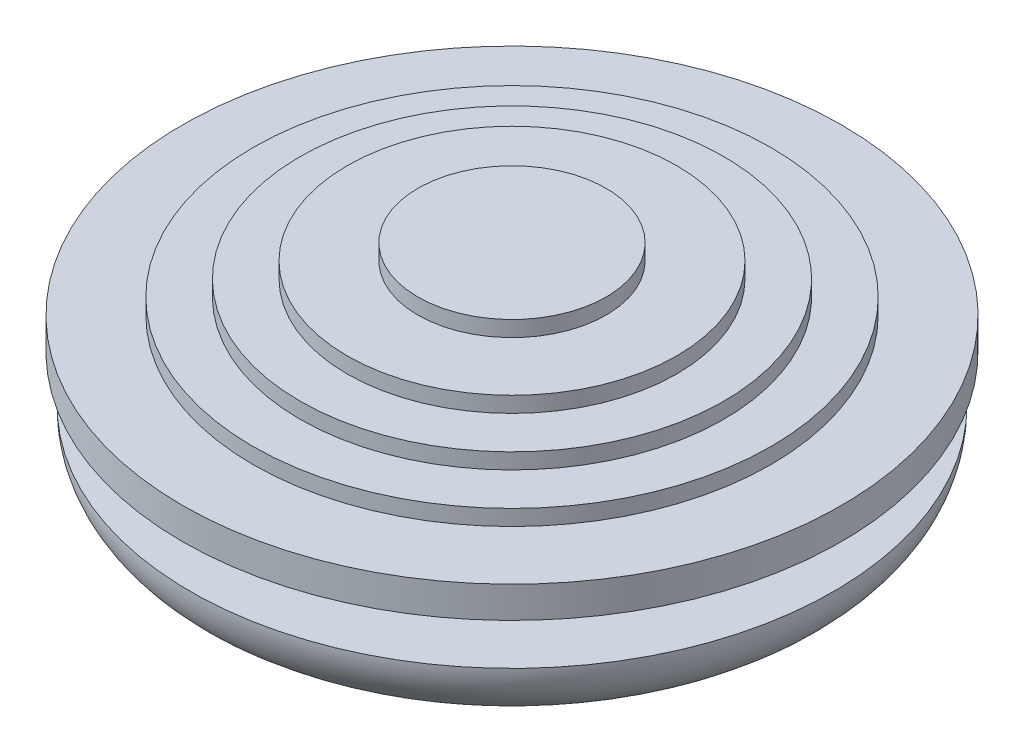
ISO-10303-21;
HEADER;
FILE_DESCRIPTION(('STEP AP214'),'2;1');
FILE_NAME('part.step','',(''),(''),'','','');
FILE_SCHEMA(('AUTOMOTIVE_DESIGN { 1 0 10303 214 1 1 1 1 }'));
ENDSEC;
DATA;
#1=APPLICATION_CONTEXT('core data for automotive mechanical design processes');
#2=APPLICATION_PROTOCOL_DEFINITION('international standard','automotive_design',2000,#1);
#3=PRODUCT_CONTEXT('',#1,'mechanical');
#4=PRODUCT('Part','Part','',(#3));
#5=PRODUCT_RELATED_PRODUCT_CATEGORY('part','',(#4));
#6=PRODUCT_DEFINITION_FORMATION('','',#4);
#7=PRODUCT_DEFINITION_CONTEXT('part definition',#1,'design');
#8=PRODUCT_DEFINITION('design','',#6,#7);
#9=PRODUCT_DEFINITION_SHAPE('','',#8);
#10=(LENGTH_UNIT() NAMED_UNIT(*) SI_UNIT(.MILLI.,.METRE.));
#11=(NAMED_UNIT(*) PLANE_ANGLE_UNIT() SI_UNIT($,.RADIAN.));
#12=(NAMED_UNIT(*) SI_UNIT($,.STERADIAN.) SOLID_ANGLE_UNIT());
#13=UNCERTAINTY_MEASURE_WITH_UNIT(LENGTH_MEASURE(1.E-05),#10,'distance_accuracy_value','');
#14=(GEOMETRIC_REPRESENTATION_CONTEXT(3) GLOBAL_UNCERTAINTY_ASSIGNED_CONTEXT((#13)) GLOBAL_UNIT_ASSIGNED_CONTEXT((#10,
#11,#12)) REPRESENTATION_CONTEXT('',''));
#15=CARTESIAN_POINT('',(0.,0.,0.));
#16=DIRECTION('',(0.,0.,1.));
#17=DIRECTION('',(1.,0.,0.));
#18=AXIS2_PLACEMENT_3D('',#15,#16,#17);
#19=CARTESIAN_POINT('',(0.,-3.,0.));
#20=DIRECTION('',(0.,-1.,0.));
#21=DIRECTION('',(0.,0.,-1.));
#22=AXIS2_PLACEMENT_3D('',#19,#20,#21);
#23=PLANE('',#22);
#24=CARTESIAN_POINT('',(0.,-3.,0.));
#25=DIRECTION('',(0.,-1.,0.));
#26=DIRECTION('',(0.,0.,-1.));
#27=AXIS2_PLACEMENT_3D('',#24,#25,#26);
#28=CIRCLE('',#27,20.5);
#29=CARTESIAN_POINT('',(0.,-3.,-20.5));
#30=VERTEX_POINT('',#29);
#31=EDGE_CURVE('E11',#30,#30,#28,.T.);
#32=ORIENTED_EDGE('',*,*,#31,.F.);
#33=EDGE_LOOP('',(#32));
#34=FACE_BOUND('',#33,.T.);
#35=CARTESIAN_POINT('',(0.,-3.,0.));
#36=DIRECTION('',(0.,-1.,0.));
#37=DIRECTION('',(0.,0.,-1.));
#38=AXIS2_PLACEMENT_3D('',#35,#36,#37);
#39=CIRCLE('',#38,16.5);
#40=CARTESIAN_POINT('',(0.,-3.,-16.5));
#41=VERTEX_POINT('',#40);
#42=EDGE_CURVE('E57',#41,#41,#39,.T.);
#43=ORIENTED_EDGE('',*,*,#42,.T.);
#44=EDGE_LOOP('',(#43));
#45=FACE_BOUND('',#44,.T.);
#46=ADVANCED_FACE('F44',(#34,#45),#23,.F.);
#47=CARTESIAN_POINT('',(0.,-7.,0.));
#48=DIRECTION('',(0.,1.,0.));
#49=DIRECTION('',(0.,0.,1.));
#50=AXIS2_PLACEMENT_3D('',#47,#48,#49);
#51=CYLINDRICAL_SURFACE('',#50,16.5);
#52=CARTESIAN_POINT('',(0.,-7.,0.));
#53=DIRECTION('',(0.,-1.,0.));
#54=DIRECTION('',(0.,0.,-1.));
#55=AXIS2_PLACEMENT_3D('',#52,#53,#54);
#56=CIRCLE('',#55,16.5);
#57=CARTESIAN_POINT('',(0.,-7.,-16.5));
#58=VERTEX_POINT('',#57);
#59=EDGE_CURVE('E52',#58,#58,#56,.T.);
#60=ORIENTED_EDGE('',*,*,#59,.T.);
#61=EDGE_LOOP('',(#60));
#62=FACE_BOUND('',#61,.T.);
#63=ORIENTED_EDGE('',*,*,#42,.F.);
#64=EDGE_LOOP('',(#63));
#65=FACE_BOUND('',#64,.T.);
#66=ADVANCED_FACE('F66',(#62,#65),#51,.F.);
#67=CARTESIAN_POINT('',(0.,-3.,0.));
#68=DIRECTION('',(0.,-1.,0.));
#69=DIRECTION('',(0.,0.,-1.));
#70=AXIS2_PLACEMENT_3D('',#67,#68,#69);
#71=TOROIDAL_SURFACE('',#70,16.5,4.);
#72=ORIENTED_EDGE('',*,*,#31,.T.);
#73=EDGE_LOOP('',(#72));
#74=FACE_BOUND('',#73,.T.);
#75=ORIENTED_EDGE('',*,*,#59,.F.);
#76=EDGE_LOOP('',(#75));
#77=FACE_BOUND('',#76,.T.);
#78=ADVANCED_FACE('F46',(#74,#77),#71,.T.);
#79=CLOSED_SHELL('',(#46,#66,#78));
#80=MANIFOLD_SOLID_BREP('B2',#79);
#81=CARTESIAN_POINT('',(0.,-3.,0.));
#82=DIRECTION('',(0.,-1.,0.));
#83=DIRECTION('',(0.,0.,-1.));
#84=AXIS2_PLACEMENT_3D('',#81,#82,#83);
#85=PLANE('',#84);
#86=CARTESIAN_POINT('',(0.,-3.,0.));
#87=DIRECTION('',(0.,-1.,0.));
#88=DIRECTION('',(0.,0.,-1.));
#89=AXIS2_PLACEMENT_3D('',#86,#87,#88);
#90=CIRCLE('',#89,16.5);
#91=CARTESIAN_POINT('',(0.,-3.,-16.5));
#92=VERTEX_POINT('',#91);
#93=EDGE_CURVE('E43',#92,#92,#90,.T.);
#94=ORIENTED_EDGE('',*,*,#93,.T.);
#95=EDGE_LOOP('',(#94));
#96=FACE_BOUND('',#95,.T.);
#97=CARTESIAN_POINT('',(0.,-3.,0.));
#98=DIRECTION('',(0.,-1.,0.));
#99=DIRECTION('',(0.,0.,-1.));
#100=AXIS2_PLACEMENT_3D('',#97,#98,#99);
#101=CIRCLE('',#100,15.5);
#102=CARTESIAN_POINT('',(0.,-3.,-15.5));
#103=VERTEX_POINT('',#102);
#104=EDGE_CURVE('E113',#103,#103,#101,.T.);
#105=ORIENTED_EDGE('',*,*,#104,.F.);
#106=EDGE_LOOP('',(#105));
#107=FACE_BOUND('',#106,.T.);
#108=ADVANCED_FACE('F102',(#96,#107),#85,.T.);
#109=CARTESIAN_POINT('',(0.,0.,0.));
#110=DIRECTION('',(0.,-1.,0.));
#111=DIRECTION('',(0.,0.,-1.));
#112=AXIS2_PLACEMENT_3D('',#109,#110,#111);
#113=PLANE('',#112);
#114=CARTESIAN_POINT('',(0.,0.,0.));
#115=DIRECTION('',(0.,-1.,0.));
#116=DIRECTION('',(0.,0.,-1.));
#117=AXIS2_PLACEMENT_3D('',#114,#115,#116);
#118=CIRCLE('',#117,16.5);
#119=CARTESIAN_POINT('',(0.,0.,-16.5));
#120=VERTEX_POINT('',#119);
#121=EDGE_CURVE('E106',#120,#120,#118,.T.);
#122=ORIENTED_EDGE('',*,*,#121,.F.);
#123=EDGE_LOOP('',(#122));
#124=FACE_BOUND('',#123,.T.);
#125=CARTESIAN_POINT('',(0.,0.,0.));
#126=DIRECTION('',(0.,-1.,0.));
#127=DIRECTION('',(0.,0.,-1.));
#128=AXIS2_PLACEMENT_3D('',#125,#126,#127);
#129=CIRCLE('',#128,15.5);
#130=CARTESIAN_POINT('',(0.,0.,-15.5));
#131=VERTEX_POINT('',#130);
#132=EDGE_CURVE('E115',#131,#131,#129,.T.);
#133=ORIENTED_EDGE('',*,*,#132,.T.);
#134=EDGE_LOOP('',(#133));
#135=FACE_BOUND('',#134,.T.);
#136=ADVANCED_FACE('F125',(#124,#135),#113,.F.);
#137=CARTESIAN_POINT('',(0.,-3.,0.));
#138=DIRECTION('',(0.,1.,0.));
#139=DIRECTION('',(0.,0.,1.));
#140=AXIS2_PLACEMENT_3D('',#137,#138,#139);
#141=CYLINDRICAL_SURFACE('',#140,16.5);
#142=ORIENTED_EDGE('',*,*,#93,.F.);
#143=EDGE_LOOP('',(#142));
#144=FACE_BOUND('',#143,.T.);
#145=ORIENTED_EDGE('',*,*,#121,.T.);
#146=EDGE_LOOP('',(#145));
#147=FACE_BOUND('',#146,.T.);
#148=ADVANCED_FACE('F104',(#144,#147),#141,.T.);
#149=CARTESIAN_POINT('',(0.,-3.,0.));
#150=DIRECTION('',(0.,1.,0.));
#151=DIRECTION('',(0.,0.,1.));
#152=AXIS2_PLACEMENT_3D('',#149,#150,#151);
#153=CYLINDRICAL_SURFACE('',#152,15.5);
#154=ORIENTED_EDGE('',*,*,#104,.T.);
#155=EDGE_LOOP('',(#154));
#156=FACE_BOUND('',#155,.T.);
#157=ORIENTED_EDGE('',*,*,#132,.F.);
#158=EDGE_LOOP('',(#157));
#159=FACE_BOUND('',#158,.T.);
#160=ADVANCED_FACE('F121',(#156,#159),#153,.F.);
#161=CLOSED_SHELL('',(#108,#136,#148,#160));
#162=MANIFOLD_SOLID_BREP('B6',#161);
#163=CARTESIAN_POINT('',(0.,6.,0.));
#164=DIRECTION('',(0.,-1.,0.));
#165=DIRECTION('',(0.,0.,-1.));
#166=AXIS2_PLACEMENT_3D('',#163,#164,#165);
#167=CYLINDRICAL_SURFACE('',#166,6.);
#168=CARTESIAN_POINT('',(0.,6.,0.));
#169=DIRECTION('',(0.,1.,0.));
#170=DIRECTION('',(0.,0.,1.));
#171=AXIS2_PLACEMENT_3D('',#168,#169,#170);
#172=CIRCLE('',#171,6.);
#173=CARTESIAN_POINT('',(0.,6.,6.));
#174=VERTEX_POINT('',#173);
#175=EDGE_CURVE('E101',#174,#174,#172,.T.);
#176=ORIENTED_EDGE('',*,*,#175,.F.);
#177=EDGE_LOOP('',(#176));
#178=FACE_BOUND('',#177,.T.);
#179=CARTESIAN_POINT('',(0.,5.,0.));
#180=DIRECTION('',(0.,1.,0.));
#181=DIRECTION('',(0.,0.,1.));
#182=AXIS2_PLACEMENT_3D('',#179,#180,#181);
#183=CIRCLE('',#182,6.);
#184=CARTESIAN_POINT('',(0.,5.,6.));
#185=VERTEX_POINT('',#184);
#186=EDGE_CURVE('E175',#185,#185,#183,.T.);
#187=ORIENTED_EDGE('',*,*,#186,.T.);
#188=EDGE_LOOP('',(#187));
#189=FACE_BOUND('',#188,.T.);
#190=ADVANCED_FACE('F172',(#178,#189),#167,.T.);
#191=CARTESIAN_POINT('',(0.,6.,0.));
#192=DIRECTION('',(0.,1.,0.));
#193=DIRECTION('',(0.,0.,1.));
#194=AXIS2_PLACEMENT_3D('',#191,#192,#193);
#195=PLANE('',#194);
#196=ORIENTED_EDGE('',*,*,#175,.T.);
#197=EDGE_LOOP('',(#196));
#198=FACE_BOUND('',#197,.T.);
#199=ADVANCED_FACE('F187',(#198),#195,.T.);
#200=CARTESIAN_POINT('',(0.,5.,0.));
#201=DIRECTION('',(0.,1.,0.));
#202=DIRECTION('',(0.,0.,1.));
#203=AXIS2_PLACEMENT_3D('',#200,#201,#202);
#204=PLANE('',#203);
#205=ORIENTED_EDGE('',*,*,#186,.F.);
#206=EDGE_LOOP('',(#205));
#207=FACE_BOUND('',#206,.T.);
#208=ADVANCED_FACE('F185',(#207),#204,.F.);
#209=CLOSED_SHELL('',(#190,#199,#208));
#210=MANIFOLD_SOLID_BREP('B38',#209);
#211=CARTESIAN_POINT('',(0.,5.,0.));
#212=DIRECTION('',(0.,-1.,0.));
#213=DIRECTION('',(0.,0.,-1.));
#214=AXIS2_PLACEMENT_3D('',#211,#212,#213);
#215=CYLINDRICAL_SURFACE('',#214,10.5);
#216=CARTESIAN_POINT('',(0.,5.,0.));
#217=DIRECTION('',(0.,1.,0.));
#218=DIRECTION('',(0.,0.,1.));
#219=AXIS2_PLACEMENT_3D('',#216,#217,#218);
#220=CIRCLE('',#219,10.5);
#221=CARTESIAN_POINT('',(0.,5.,10.5));
#222=VERTEX_POINT('',#221);
#223=EDGE_CURVE('E171',#222,#222,#220,.T.);
#224=ORIENTED_EDGE('',*,*,#223,.F.);
#225=EDGE_LOOP('',(#224));
#226=FACE_BOUND('',#225,.T.);
#227=CARTESIAN_POINT('',(0.,4.,0.));
#228=DIRECTION('',(0.,1.,0.));
#229=DIRECTION('',(0.,0.,1.));
#230=AXIS2_PLACEMENT_3D('',#227,#228,#229);
#231=CIRCLE('',#230,10.5);
#232=CARTESIAN_POINT('',(0.,4.,10.5));
#233=VERTEX_POINT('',#232);
#234=EDGE_CURVE('E228',#233,#233,#231,.T.);
#235=ORIENTED_EDGE('',*,*,#234,.T.);
#236=EDGE_LOOP('',(#235));
#237=FACE_BOUND('',#236,.T.);
#238=ADVANCED_FACE('F221',(#226,#237),#215,.T.);
#239=CARTESIAN_POINT('',(0.,5.,0.));
#240=DIRECTION('',(0.,1.,0.));
#241=DIRECTION('',(0.,0.,1.));
#242=AXIS2_PLACEMENT_3D('',#239,#240,#241);
#243=PLANE('',#242);
#244=CARTESIAN_POINT('',(0.,5.,0.));
#245=DIRECTION('',(0.,1.,0.));
#246=DIRECTION('',(0.,0.,1.));
#247=AXIS2_PLACEMENT_3D('',#244,#245,#246);
#248=CIRCLE('',#247,6.);
#249=CARTESIAN_POINT('',(0.,5.,6.));
#250=VERTEX_POINT('',#249);
#251=EDGE_CURVE('E234',#250,#250,#248,.T.);
#252=ORIENTED_EDGE('',*,*,#251,.F.);
#253=EDGE_LOOP('',(#252));
#254=FACE_BOUND('',#253,.T.);
#255=ORIENTED_EDGE('',*,*,#223,.T.);
#256=EDGE_LOOP('',(#255));
#257=FACE_BOUND('',#256,.T.);
#258=ADVANCED_FACE('F250',(#254,#257),#243,.T.);
#259=CARTESIAN_POINT('',(0.,4.,0.));
#260=DIRECTION('',(0.,1.,0.));
#261=DIRECTION('',(0.,0.,1.));
#262=AXIS2_PLACEMENT_3D('',#259,#260,#261);
#263=PLANE('',#262);
#264=CARTESIAN_POINT('',(0.,4.,0.));
#265=DIRECTION('',(0.,1.,0.));
#266=DIRECTION('',(0.,0.,1.));
#267=AXIS2_PLACEMENT_3D('',#264,#265,#266);
#268=CIRCLE('',#267,6.);
#269=CARTESIAN_POINT('',(0.,4.,6.));
#270=VERTEX_POINT('',#269);
#271=EDGE_CURVE('E224',#270,#270,#268,.T.);
#272=ORIENTED_EDGE('',*,*,#271,.T.);
#273=EDGE_LOOP('',(#272));
#274=FACE_BOUND('',#273,.T.);
#275=ORIENTED_EDGE('',*,*,#234,.F.);
#276=EDGE_LOOP('',(#275));
#277=FACE_BOUND('',#276,.T.);
#278=ADVANCED_FACE('F241',(#274,#277),#263,.F.);
#279=CARTESIAN_POINT('',(0.,3.,0.));
#280=DIRECTION('',(0.,1.,0.));
#281=DIRECTION('',(0.,0.,1.));
#282=AXIS2_PLACEMENT_3D('',#279,#280,#281);
#283=CYLINDRICAL_SURFACE('',#282,6.);
#284=ORIENTED_EDGE('',*,*,#251,.T.);
#285=EDGE_LOOP('',(#284));
#286=FACE_BOUND('',#285,.T.);
#287=ORIENTED_EDGE('',*,*,#271,.F.);
#288=EDGE_LOOP('',(#287));
#289=FACE_BOUND('',#288,.T.);
#290=ADVANCED_FACE('F244',(#286,#289),#283,.F.);
#291=CLOSED_SHELL('',(#238,#258,#278,#290));
#292=MANIFOLD_SOLID_BREP('B96',#291);
#293=CARTESIAN_POINT('',(0.,4.,0.));
#294=DIRECTION('',(0.,-1.,0.));
#295=DIRECTION('',(0.,0.,-1.));
#296=AXIS2_PLACEMENT_3D('',#293,#294,#295);
#297=CYLINDRICAL_SURFACE('',#296,13.5);
#298=CARTESIAN_POINT('',(0.,4.,0.));
#299=DIRECTION('',(0.,1.,0.));
#300=DIRECTION('',(0.,0.,1.));
#301=AXIS2_PLACEMENT_3D('',#298,#299,#300);
#302=CIRCLE('',#301,13.5);
#303=CARTESIAN_POINT('',(0.,4.,13.5));
#304=VERTEX_POINT('',#303);
#305=EDGE_CURVE('E220',#304,#304,#302,.T.);
#306=ORIENTED_EDGE('',*,*,#305,.F.);
#307=EDGE_LOOP('',(#306));
#308=FACE_BOUND('',#307,.T.);
#309=CARTESIAN_POINT('',(0.,3.,0.));
#310=DIRECTION('',(0.,1.,0.));
#311=DIRECTION('',(0.,0.,1.));
#312=AXIS2_PLACEMENT_3D('',#309,#310,#311);
#313=CIRCLE('',#312,13.5);
#314=CARTESIAN_POINT('',(0.,3.,13.5));
#315=VERTEX_POINT('',#314);
#316=EDGE_CURVE('E298',#315,#315,#313,.T.);
#317=ORIENTED_EDGE('',*,*,#316,.T.);
#318=EDGE_LOOP('',(#317));
#319=FACE_BOUND('',#318,.T.);
#320=ADVANCED_FACE('F291',(#308,#319),#297,.T.);
#321=CARTESIAN_POINT('',(0.,4.,0.));
#322=DIRECTION('',(0.,1.,0.));
#323=DIRECTION('',(0.,0.,1.));
#324=AXIS2_PLACEMENT_3D('',#321,#322,#323);
#325=PLANE('',#324);
#326=CARTESIAN_POINT('',(0.,4.,0.));
#327=DIRECTION('',(0.,1.,0.));
#328=DIRECTION('',(0.,0.,1.));
#329=AXIS2_PLACEMENT_3D('',#326,#327,#328);
#330=CIRCLE('',#329,10.5);
#331=CARTESIAN_POINT('',(0.,4.,10.5));
#332=VERTEX_POINT('',#331);
#333=EDGE_CURVE('E304',#332,#332,#330,.T.);
#334=ORIENTED_EDGE('',*,*,#333,.F.);
#335=EDGE_LOOP('',(#334));
#336=FACE_BOUND('',#335,.T.);
#337=ORIENTED_EDGE('',*,*,#305,.T.);
#338=EDGE_LOOP('',(#337));
#339=FACE_BOUND('',#338,.T.);
#340=ADVANCED_FACE('F320',(#336,#339),#325,.T.);
#341=CARTESIAN_POINT('',(0.,3.,0.));
#342=DIRECTION('',(0.,1.,0.));
#343=DIRECTION('',(0.,0.,1.));
#344=AXIS2_PLACEMENT_3D('',#341,#342,#343);
#345=PLANE('',#344);
#346=CARTESIAN_POINT('',(0.,3.,0.));
#347=DIRECTION('',(0.,1.,0.));
#348=DIRECTION('',(0.,0.,1.));
#349=AXIS2_PLACEMENT_3D('',#346,#347,#348);
#350=CIRCLE('',#349,10.5);
#351=CARTESIAN_POINT('',(0.,3.,10.5));
#352=VERTEX_POINT('',#351);
#353=EDGE_CURVE('E294',#352,#352,#350,.T.);
#354=ORIENTED_EDGE('',*,*,#353,.T.);
#355=EDGE_LOOP('',(#354));
#356=FACE_BOUND('',#355,.T.);
#357=ORIENTED_EDGE('',*,*,#316,.F.);
#358=EDGE_LOOP('',(#357));
#359=FACE_BOUND('',#358,.T.);
#360=ADVANCED_FACE('F311',(#356,#359),#345,.F.);
#361=CARTESIAN_POINT('',(0.,2.,0.));
#362=DIRECTION('',(0.,1.,0.));
#363=DIRECTION('',(0.,0.,1.));
#364=AXIS2_PLACEMENT_3D('',#361,#362,#363);
#365=CYLINDRICAL_SURFACE('',#364,10.5);
#366=ORIENTED_EDGE('',*,*,#333,.T.);
#367=EDGE_LOOP('',(#366));
#368=FACE_BOUND('',#367,.T.);
#369=ORIENTED_EDGE('',*,*,#353,.F.);
#370=EDGE_LOOP('',(#369));
#371=FACE_BOUND('',#370,.T.);
#372=ADVANCED_FACE('F314',(#368,#371),#365,.F.);
#373=CLOSED_SHELL('',(#320,#340,#360,#372));
#374=MANIFOLD_SOLID_BREP('B166',#373);
#375=CARTESIAN_POINT('',(0.,3.,0.));
#376=DIRECTION('',(0.,-1.,0.));
#377=DIRECTION('',(0.,0.,-1.));
#378=AXIS2_PLACEMENT_3D('',#375,#376,#377);
#379=CYLINDRICAL_SURFACE('',#378,16.5);
#380=CARTESIAN_POINT('',(0.,3.,0.));
#381=DIRECTION('',(0.,1.,0.));
#382=DIRECTION('',(0.,0.,1.));
#383=AXIS2_PLACEMENT_3D('',#380,#381,#382);
#384=CIRCLE('',#383,16.5);
#385=CARTESIAN_POINT('',(0.,3.,16.5));
#386=VERTEX_POINT('',#385);
#387=EDGE_CURVE('E290',#386,#386,#384,.T.);
#388=ORIENTED_EDGE('',*,*,#387,.F.);
#389=EDGE_LOOP('',(#388));
#390=FACE_BOUND('',#389,.T.);
#391=CARTESIAN_POINT('',(0.,2.,0.));
#392=DIRECTION('',(0.,1.,0.));
#393=DIRECTION('',(0.,0.,1.));
#394=AXIS2_PLACEMENT_3D('',#391,#392,#393);
#395=CIRCLE('',#394,16.5);
#396=CARTESIAN_POINT('',(0.,2.,16.5));
#397=VERTEX_POINT('',#396);
#398=EDGE_CURVE('E367',#397,#397,#395,.T.);
#399=ORIENTED_EDGE('',*,*,#398,.T.);
#400=EDGE_LOOP('',(#399));
#401=FACE_BOUND('',#400,.T.);
#402=ADVANCED_FACE('F360',(#390,#401),#379,.T.);
#403=CARTESIAN_POINT('',(0.,3.,0.));
#404=DIRECTION('',(0.,1.,0.));
#405=DIRECTION('',(0.,0.,1.));
#406=AXIS2_PLACEMENT_3D('',#403,#404,#405);
#407=PLANE('',#406);
#408=CARTESIAN_POINT('',(0.,3.,0.));
#409=DIRECTION('',(0.,1.,0.));
#410=DIRECTION('',(0.,0.,1.));
#411=AXIS2_PLACEMENT_3D('',#408,#409,#410);
#412=CIRCLE('',#411,13.5);
#413=CARTESIAN_POINT('',(0.,3.,13.5));
#414=VERTEX_POINT('',#413);
#415=EDGE_CURVE('E373',#414,#414,#412,.T.);
#416=ORIENTED_EDGE('',*,*,#415,.F.);
#417=EDGE_LOOP('',(#416));
#418=FACE_BOUND('',#417,.T.);
#419=ORIENTED_EDGE('',*,*,#387,.T.);
#420=EDGE_LOOP('',(#419));
#421=FACE_BOUND('',#420,.T.);
#422=ADVANCED_FACE('F389',(#418,#421),#407,.T.);
#423=CARTESIAN_POINT('',(0.,2.,0.));
#424=DIRECTION('',(0.,1.,0.));
#425=DIRECTION('',(0.,0.,1.));
#426=AXIS2_PLACEMENT_3D('',#423,#424,#425);
#427=PLANE('',#426);
#428=CARTESIAN_POINT('',(0.,2.,0.));
#429=DIRECTION('',(0.,1.,0.));
#430=DIRECTION('',(0.,0.,1.));
#431=AXIS2_PLACEMENT_3D('',#428,#429,#430);
#432=CIRCLE('',#431,13.5);
#433=CARTESIAN_POINT('',(0.,2.,13.5));
#434=VERTEX_POINT('',#433);
#435=EDGE_CURVE('E363',#434,#434,#432,.T.);
#436=ORIENTED_EDGE('',*,*,#435,.T.);
#437=EDGE_LOOP('',(#436));
#438=FACE_BOUND('',#437,.T.);
#439=ORIENTED_EDGE('',*,*,#398,.F.);
#440=EDGE_LOOP('',(#439));
#441=FACE_BOUND('',#440,.T.);
#442=ADVANCED_FACE('F380',(#438,#441),#427,.F.);
#443=CARTESIAN_POINT('',(0.,1.,0.));
#444=DIRECTION('',(0.,1.,0.));
#445=DIRECTION('',(0.,0.,1.));
#446=AXIS2_PLACEMENT_3D('',#443,#444,#445);
#447=CYLINDRICAL_SURFACE('',#446,13.5);
#448=ORIENTED_EDGE('',*,*,#415,.T.);
#449=EDGE_LOOP('',(#448));
#450=FACE_BOUND('',#449,.T.);
#451=ORIENTED_EDGE('',*,*,#435,.F.);
#452=EDGE_LOOP('',(#451));
#453=FACE_BOUND('',#452,.T.);
#454=ADVANCED_FACE('F383',(#450,#453),#447,.F.);
#455=CLOSED_SHELL('',(#402,#422,#442,#454));
#456=MANIFOLD_SOLID_BREP('B215',#455);
#457=CARTESIAN_POINT('',(0.,2.,0.));
#458=DIRECTION('',(0.,-1.,0.));
#459=DIRECTION('',(0.,0.,-1.));
#460=AXIS2_PLACEMENT_3D('',#457,#458,#459);
#461=CYLINDRICAL_SURFACE('',#460,21.);
#462=CARTESIAN_POINT('',(0.,2.,0.));
#463=DIRECTION('',(0.,1.,0.));
#464=DIRECTION('',(0.,0.,1.));
#465=AXIS2_PLACEMENT_3D('',#462,#463,#464);
#466=CIRCLE('',#465,21.);
#467=CARTESIAN_POINT('',(0.,2.,21.));
#468=VERTEX_POINT('',#467);
#469=EDGE_CURVE('E359',#468,#468,#466,.T.);
#470=ORIENTED_EDGE('',*,*,#469,.F.);
#471=EDGE_LOOP('',(#470));
#472=FACE_BOUND('',#471,.T.);
#473=CARTESIAN_POINT('',(0.,0.,0.));
#474=DIRECTION('',(0.,1.,0.));
#475=DIRECTION('',(0.,0.,1.));
#476=AXIS2_PLACEMENT_3D('',#473,#474,#475);
#477=CIRCLE('',#476,21.);
#478=CARTESIAN_POINT('',(0.,0.,21.));
#479=VERTEX_POINT('',#478);
#480=EDGE_CURVE('E425',#479,#479,#477,.T.);
#481=ORIENTED_EDGE('',*,*,#480,.T.);
#482=EDGE_LOOP('',(#481));
#483=FACE_BOUND('',#482,.T.);
#484=ADVANCED_FACE('F422',(#472,#483),#461,.T.);
#485=CARTESIAN_POINT('',(0.,2.,0.));
#486=DIRECTION('',(0.,1.,0.));
#487=DIRECTION('',(0.,0.,1.));
#488=AXIS2_PLACEMENT_3D('',#485,#486,#487);
#489=PLANE('',#488);
#490=CARTESIAN_POINT('',(0.,2.,0.));
#491=DIRECTION('',(0.,1.,0.));
#492=DIRECTION('',(0.,0.,1.));
#493=AXIS2_PLACEMENT_3D('',#490,#491,#492);
#494=CIRCLE('',#493,16.5);
#495=CARTESIAN_POINT('',(0.,2.,16.5));
#496=VERTEX_POINT('',#495);
#497=EDGE_CURVE('E434',#496,#496,#494,.T.);
#498=ORIENTED_EDGE('',*,*,#497,.F.);
#499=EDGE_LOOP('',(#498));
#500=FACE_BOUND('',#499,.T.);
#501=ORIENTED_EDGE('',*,*,#469,.T.);
#502=EDGE_LOOP('',(#501));
#503=FACE_BOUND('',#502,.T.);
#504=ADVANCED_FACE('F449',(#500,#503),#489,.T.);
#505=CARTESIAN_POINT('',(0.,0.,0.));
#506=DIRECTION('',(0.,1.,0.));
#507=DIRECTION('',(0.,0.,1.));
#508=AXIS2_PLACEMENT_3D('',#505,#506,#507);
#509=PLANE('',#508);
#510=CARTESIAN_POINT('',(0.,0.,0.));
#511=DIRECTION('',(0.,1.,0.));
#512=DIRECTION('',(0.,0.,1.));
#513=AXIS2_PLACEMENT_3D('',#510,#511,#512);
#514=CIRCLE('',#513,16.5);
#515=CARTESIAN_POINT('',(0.,0.,16.5));
#516=VERTEX_POINT('',#515);
#517=EDGE_CURVE('E432',#516,#516,#514,.T.);
#518=ORIENTED_EDGE('',*,*,#517,.T.);
#519=EDGE_LOOP('',(#518));
#520=FACE_BOUND('',#519,.T.);
#521=ORIENTED_EDGE('',*,*,#480,.F.);
#522=EDGE_LOOP('',(#521));
#523=FACE_BOUND('',#522,.T.);
#524=ADVANCED_FACE('F440',(#520,#523),#509,.F.);
#525=CARTESIAN_POINT('',(0.,0.,0.));
#526=DIRECTION('',(0.,1.,0.));
#527=DIRECTION('',(0.,0.,1.));
#528=AXIS2_PLACEMENT_3D('',#525,#526,#527);
#529=CYLINDRICAL_SURFACE('',#528,16.5);
#530=ORIENTED_EDGE('',*,*,#517,.F.);
#531=EDGE_LOOP('',(#530));
#532=FACE_BOUND('',#531,.T.);
#533=ORIENTED_EDGE('',*,*,#497,.T.);
#534=EDGE_LOOP('',(#533));
#535=FACE_BOUND('',#534,.T.);
#536=ADVANCED_FACE('F443',(#532,#535),#529,.F.);
#537=CLOSED_SHELL('',(#484,#504,#524,#536));
#538=MANIFOLD_SOLID_BREP('B285',#537);
#539=ADVANCED_BREP_SHAPE_REPRESENTATION('',(#18,#80,#162,#210,#292,#374,#456,#538),#14);
#540=SHAPE_DEFINITION_REPRESENTATION(#9,#539);
ENDSEC;
END-ISO-10303-21;
